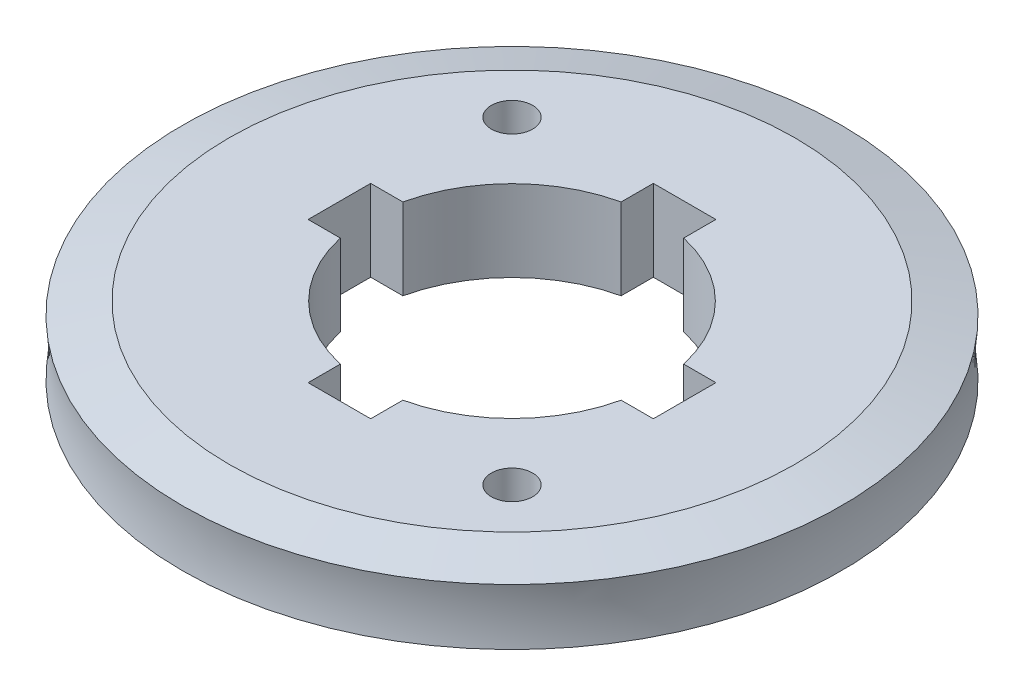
from build123d import *

# Parameters (mm, degrees)
ESQUISSE2_R             = 10
ENL_V_MAT_EXTRU_1_DEPTH = 10
ESQUISSE5_R             = 11.5
ENL_V_MAT_EXTRU_2_DEPTH = 38.827172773
ESQUISSE7_OUTSIDE_W     = 69.662
ESQUISSE7_OUTSIDE_H     = 69.662
ESQUISSE7_OUTSIDE_R     = 14.25
ENL_V_MAT_EXTRU_4_DEPTH = 0.3
ESQUISSE8_W             = 2.57502784
ESQUISSE8_H             = 5
ESQUISSE8_W_2           = 5
ESQUISSE8_H_2           = 2.57502784
ENL_V_MAT_EXTRU_5_DEPTH = 38.827172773
ESQUISSE9_R             = 1.65
ENL_V_MAT_EXTRU_6_DEPTH = 38.776778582


with BuildPart() as part:
    # Esquisse1 → R_volution1 (revolve)
    with BuildSketch(Plane.XY, mode=Mode.PRIVATE) as r_volution1_sk:
        with BuildLine():
            Line((3, 0), (22.617949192, 0))
            Line((22.617949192, 0), (26.35, 1))
            ThreePointArc((26.35, 1), (26.191006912, 3.25), (26.35, 5.5))
            Line((26.35, 5.5), (22.617949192, 6.5))
            Line((22.617949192, 6.5), (10, 6.5))
            Line((10, 6.5), (10, 16.5))
            Line((10, 16.5), (3, 16.5))
            Line((3, 16.5), (3, 0))
        make_face()
    revolve(r_volution1_sk.sketch.rotate(Axis((0, 0, 0), (0, 1, 0)), 90), axis=Axis((0, 0, 0), (0, 1, 0)))

    # Esquisse2 → Enl_v. mat.-Extru.1 (cut)
    with BuildSketch(Plane(origin=(0, 16.5, 0), x_dir=(-1, 0, 0), z_dir=(0, 1, 0))):
        Circle(ESQUISSE2_R)
    extrude(amount=-ENL_V_MAT_EXTRU_1_DEPTH, mode=Mode.SUBTRACT)

    # Esquisse5 → Enl_v. mat.-Extru.2 (cut, through all)
    with BuildSketch(Plane(origin=(0, 6.5, 0), x_dir=(-1, 0, 0), z_dir=(0, 1, 0))):
        with Locations(Location((0, 0, 0), (0, 0, 90))):
            Circle(ESQUISSE5_R)
    extrude(amount=-ENL_V_MAT_EXTRU_2_DEPTH, mode=Mode.SUBTRACT)

    # Esquisse7 outside → Enl_v. mat.-Extru.4 (cut)
    with BuildSketch(Plane.XZ):
        Rectangle(ESQUISSE7_OUTSIDE_W, ESQUISSE7_OUTSIDE_H)
        with Locations(Location((0, 0, 0), (0, 0, 270))):
            Circle(ESQUISSE7_OUTSIDE_R, mode=Mode.SUBTRACT)
    extrude(amount=-ENL_V_MAT_EXTRU_4_DEPTH, mode=Mode.SUBTRACT)

    # Esquisse8 → Enl_v. mat.-Extru.5 (cut, through all)
    with BuildSketch(Plane(origin=(0, 6.5, 0), x_dir=(-1, 0, 0), z_dir=(0, 1, 0))):
        with Locations((12.51248608, 0)):
            Rectangle(ESQUISSE8_W, ESQUISSE8_H)
        with Locations((-12.51248608, 0)):
            Rectangle(ESQUISSE8_W, ESQUISSE8_H)
        with Locations((0, -12.51248608)):
            Rectangle(ESQUISSE8_W_2, ESQUISSE8_H_2)
        with Locations((0, 12.51248608)):
            Rectangle(ESQUISSE8_W_2, ESQUISSE8_H_2)
    extrude(amount=-ENL_V_MAT_EXTRU_5_DEPTH, mode=Mode.SUBTRACT)

    # Esquisse9 → Enl_v. mat.-Extru.6 (cut, through all)
    with BuildSketch(Plane.XZ.offset(-0.3)):
        with Locations(Location((12.727922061, 12.727922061, 0), (0, 0, 270))):
            Circle(ESQUISSE9_R)
        with Locations(Location((-12.727922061, -12.727922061, 0), (0, 0, 270))):
            Circle(ESQUISSE9_R)
    extrude(amount=-ENL_V_MAT_EXTRU_6_DEPTH, mode=Mode.SUBTRACT)


solid = part.part
